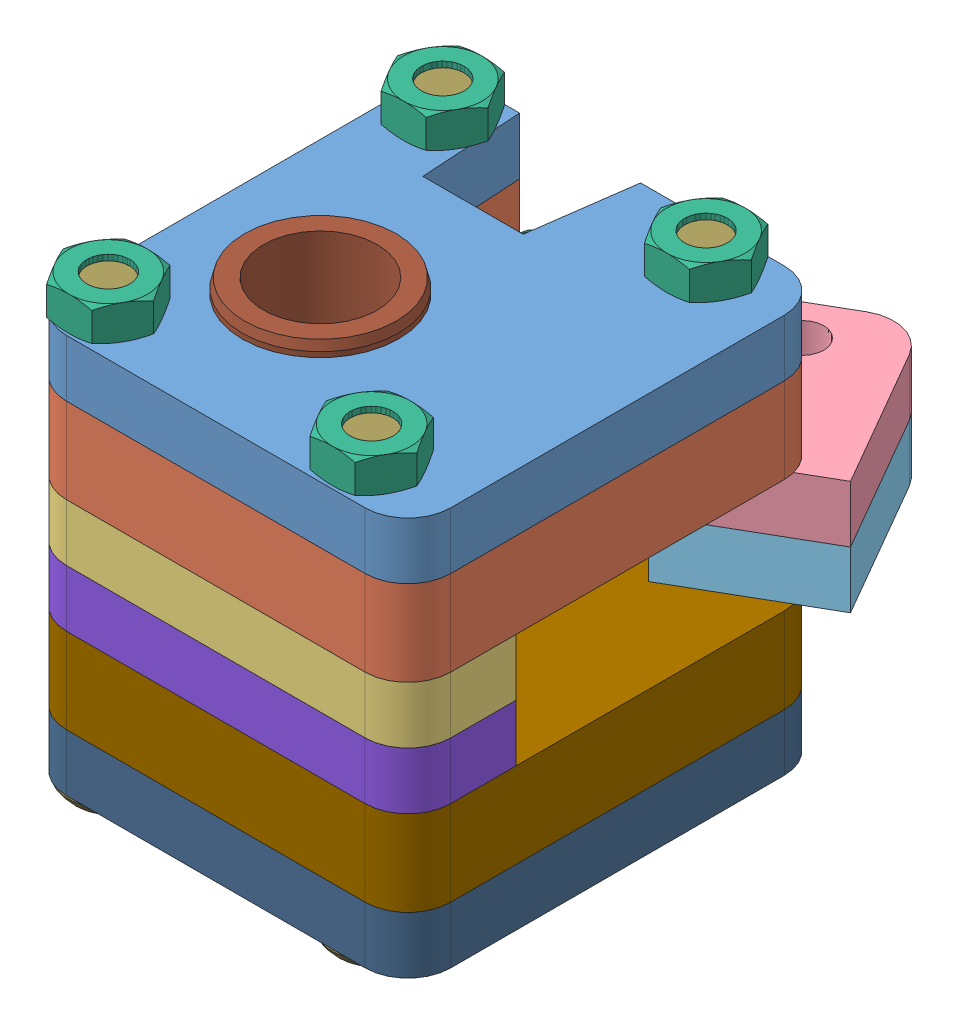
SolidWorks assembly UM_3010_ASM.sldasm, configuration Default (file format 5000). Lengths in mm.
Overall size (30.53 32.3 41.05).
23 component instances, 12 part files, 0 mates.
Components (placement in the parent):
- UM_3011-1: UM_3011.sldprt [Default] at origin size (27 4 29.45)
- UM_3012-1: UM_3012.sldprt [Default] at (0 -5 0) size (27 6 29.45)
- UM_3013-1: UM_3013.sldprt [Default] at (0 -10 0) size (27 4.01 19.37)
- UM_3020_ASM-1: UM_3020_ASM.sldasm [Default] at (3.3732 -10 -6.1959) x (0.866025 0 -0.5) z (0.5 0 0.866025) size (27 19.5 14.3)
  - UM_3014-1: UM_3014.sldprt [Default] at origin size (27 4 14.3)
  - UM_3016-1: UM_3016.sldprt [Default] at (0 -4 0) size (27 4 14.3)
  - DIN934_M3-1: DIN934_M3.sldprt [Default] at (-3.05 -8.4 -8.125) x (-1 0 0) z (0 1 0) size (6.35 5.5 2.4)
  - DIN934_M3-2: DIN934_M3.sldprt [Default] at (-3.05 -10.8 -8.125) x (-1 0 0) z (0 1 0) size (6.35 5.5 2.4)
  - DIN934_M3-3: DIN934_M3.sldprt [Default] at (-3.05 4.4 -8.125) x (1 0 0) z (0 -1 0) size (6.35 5.5 2.4)
  - DIN934_M3-4: DIN934_M3.sldprt [Default] at (-3.05 6.8 -8.125) x (1 0 0) z (0 -1 0) size (6.35 5.5 2.4)
  - ISO7380_M3X16-1: ISO7380_M3X16.sldprt [Default] at (-3.05 -10.8 -8.125) x (-1 0 0) z (0 0 1) size (5.77 17.9 5.75)
- UM_3015-1: UM_3015.sldprt [Default] at (0 -14 0) size (27 4.01 19.37)
- UM_3017-1: UM_3017.sldprt [Default] at (0 -19 0) size (27 6 29.45)
- UM_3018-1: UM_3018.sldprt [Default] at (0 -24 0) size (27 4 29.45)
- SLIDE_BEARING_8X11X30-1: SLIDE_BEARING_8X11X30.sldprt [Default] at (-4.1 -12 3.275) x (0 1 0) z (0 0 1) size (30 11 11)
- ISO7380_M3X30-1: ISO7380_M3X30.sldprt [Default] at (-10.5 -26 11.775) x (-1 0 0) z (0 0 1) size (5.77 31.9 5.75)
- ISO7380_M3X30-2: ISO7380_M3X30.sldprt [Default] at (8 -26 11.775) x (-1 0 0) z (0 0 1) size (5.77 31.9 5.75)
- DIN934_M3-1: DIN934_M3.sldprt [Default] at (8 4.4 11.775) x (1 0 0) z (0 -1 0) size (6.35 5.5 2.4)
- DIN934_M3-2: DIN934_M3.sldprt [Default] at (-10.5 4.4 11.775) x (1 0 0) z (0 -1 0) size (6.35 5.5 2.4)
- ISO7380_M3X30-3: ISO7380_M3X30.sldprt [Default] at (-10.5 -26 -11.725) x (-1 0 0) z (0 0 1) size (5.77 31.9 5.75)
- DIN934_M3-3: DIN934_M3.sldprt [Default] at (-10.5 4.4 -11.725) x (1 0 0) z (0 -1 0) size (6.35 5.5 2.4)
- ISO7380_M3X30-4: ISO7380_M3X30.sldprt [Default] at (8 -26 -11.725) x (-1 0 0) z (0 0 1) size (5.77 31.9 5.75)
- DIN934_M3-4: DIN934_M3.sldprt [Default] at (8 4.4 -11.725) x (1 0 0) z (0 -1 0) size (6.35 5.5 2.4)
